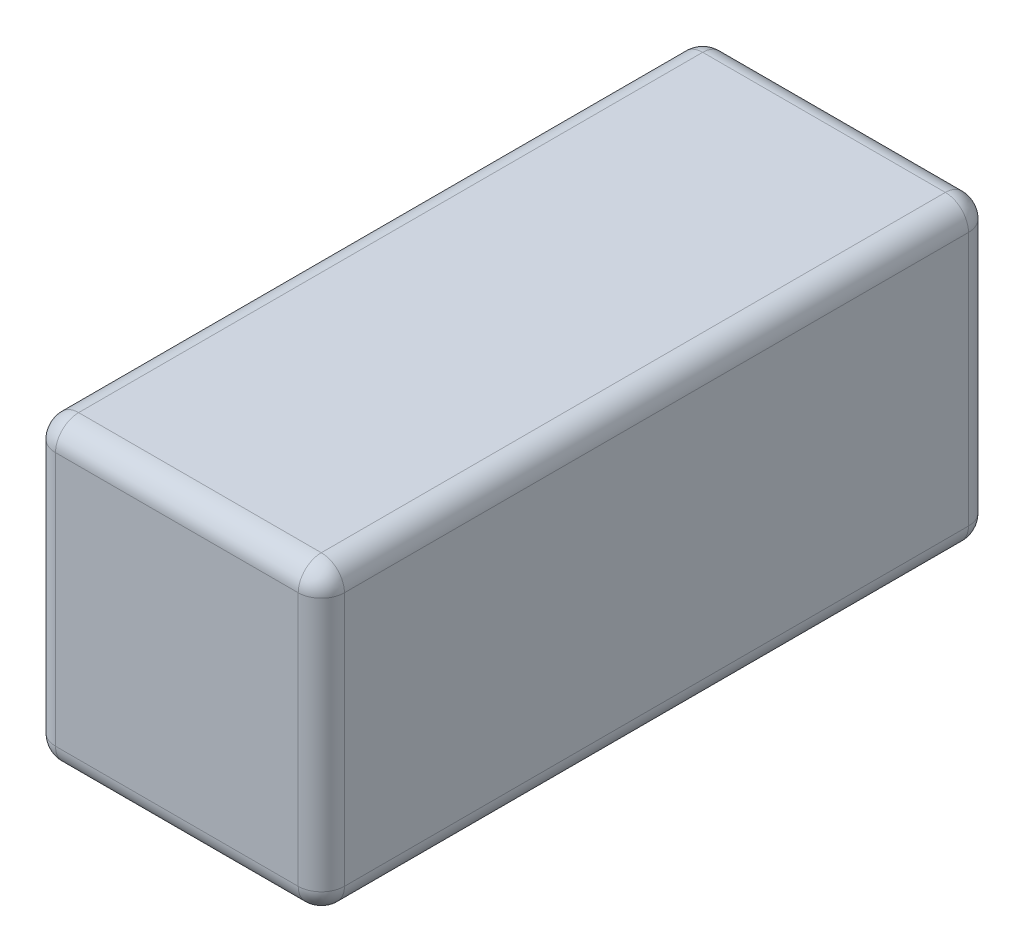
from build123d import *

# Parameters (mm, degrees)
SKETCH1_W           = 25
SKETCH1_H           = 26
BOSS_EXTRUDE1_DEPTH = 29
FILLET1_R           = 2


with BuildPart() as part:
    # Sketch1 → Boss-Extrude1 (new, symmetric)
    with BuildSketch(Plane.XY):
        Rectangle(SKETCH1_W, SKETCH1_H)
    extrude(amount=BOSS_EXTRUDE1_DEPTH, both=True)

    # Fillet1
    fillet1_edges = [part.edges().sort_by_distance(p)[0] for p in [
        (12.5, 0, 29),
        (0, 13, 29),
        (-12.5, 0, 29),
        (0, 13, -29),
        (12.5, 0, -29),
        (0, -13, -29),
        (-12.5, 0, -29),
        (-12.5, 13, 0),
        (12.5, 13, 0),
        (12.5, -13, 0),
        (-12.5, -13, 0),
        (0, -13, 29),
    ]]
    fillet(fillet1_edges, radius=FILLET1_R)


solid = part.part
